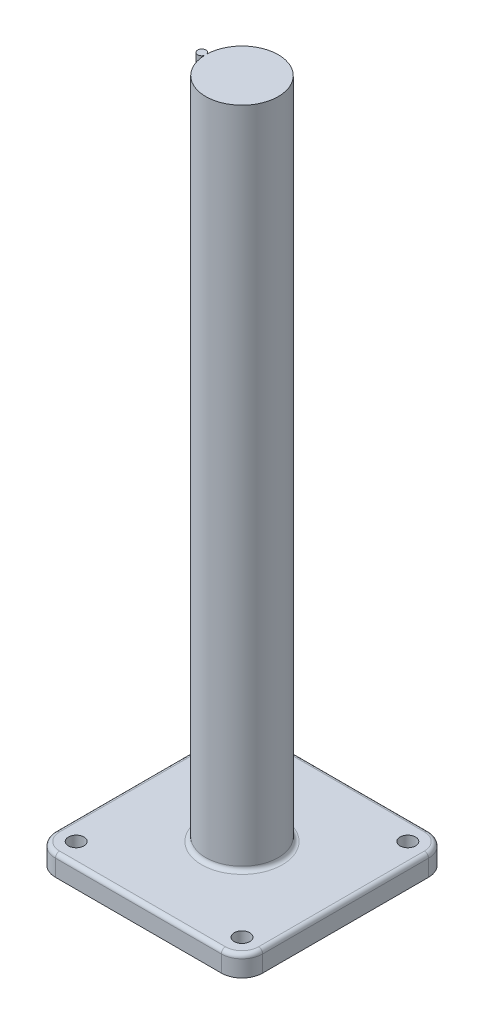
from build123d import *

# Parameters (mm, degrees)
SKETCH1_R      = 4.7625
EXTRUDE1_DEPTH = 12.7
SKETCH3_W      = 22.225
SKETCH3_H      = 406.4
FILLET2_R      = 2.54
EXTRUDE2_START = -406.400002
SKETCH4_R      = 2.54
EXTRUDE2_DEPTH = 406.400002


with BuildPart() as part:
    # Sketch1 → Extrude1 (new body)
    with BuildSketch(Plane(origin=(0, 0, 0), x_dir=(1, 0, 0), z_dir=(0, 1, 0))):
        with BuildLine():
            Line((-50.8, -63.5), (50.8, -63.5))
            ThreePointArc((50.8, -63.5), (59.780256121, -59.780256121), (63.5, -50.8))
            Line((63.5, -50.8), (63.5, 50.8))
            ThreePointArc((63.5, 50.8), (59.780256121, 59.780256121), (50.8, 63.5))
            Line((50.8, 63.5), (-50.8, 63.5))
            ThreePointArc((-50.8, 63.5), (-59.780256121, 59.780256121), (-63.5, 50.8))
            Line((-63.5, 50.8), (-63.5, -50.8))
            ThreePointArc((-63.5, -50.8), (-59.780256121, -59.780256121), (-50.8, -63.5))
        make_face()
        with Locations(Location((-50.8, 50.8, 0), (0, 0, 270))):
            Circle(SKETCH1_R, mode=Mode.SUBTRACT)
        with Locations(Location((50.8, 50.8, 0), (0, 0, 270))):
            Circle(SKETCH1_R, mode=Mode.SUBTRACT)
        with Locations(Location((50.8, -50.8, 0), (0, 0, 270))):
            Circle(SKETCH1_R, mode=Mode.SUBTRACT)
        with Locations(Location((-50.8, -50.8, 0), (0, 0, 270))):
            Circle(SKETCH1_R, mode=Mode.SUBTRACT)
    extrude(amount=EXTRUDE1_DEPTH)

    # Sketch3 → Revolve1 (revolve)
    with BuildSketch(Plane.XY, mode=Mode.PRIVATE) as revolve1_sk:
        with Locations((11.1125, 215.9)):
            Rectangle(SKETCH3_W, SKETCH3_H)
    revolve(revolve1_sk.sketch.rotate(Axis((0, 0, 0), (0, 1, 0)), 90), axis=Axis((0, 0, 0), (0, 1, 0)))

    # Fillet2
    fillet2_edges = [part.edges().sort_by_distance(p)[0] for p in [
        (59.780256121, 12.7, -59.780256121),
        (0, 12.7, -63.5),
        (-59.780256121, 12.7, -59.780256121),
        (-63.5, 12.7, 0),
        (-59.780256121, 12.7, 59.780256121),
        (0, 12.7, 63.5),
        (0, 12.7, 22.225),
        (59.780256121, 12.7, 59.780256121),
        (63.5, 12.7, 0),
    ]]
    fillet(fillet2_edges, radius=FILLET2_R)

    # Sketch4 → Extrude2 (add)
    with BuildSketch(Plane(origin=(0, 419.1, 0), x_dir=(-1, 0, 0), z_dir=(0, 1, 0)).offset(EXTRUDE2_START)):
        with Locations((24.638, 0)):
            Circle(SKETCH4_R)
    extrude(amount=EXTRUDE2_DEPTH)


solid = part.part
